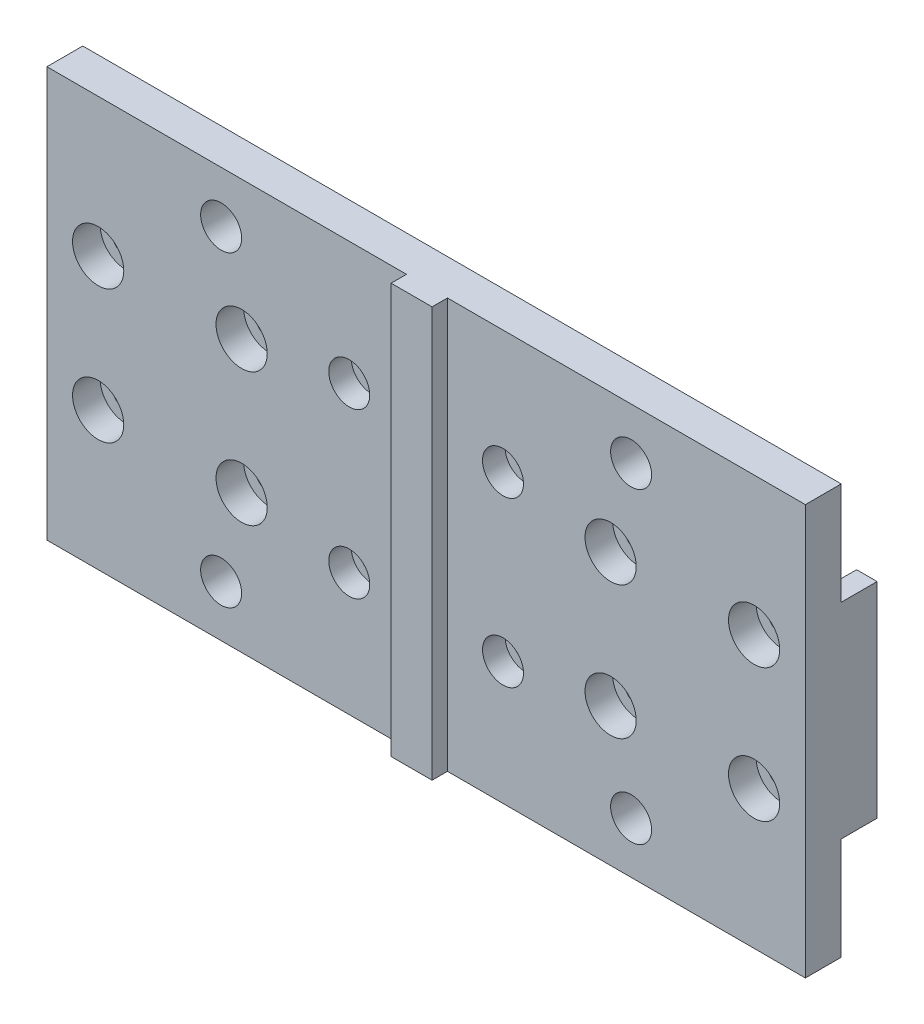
from build123d import *

# Parameters (mm, degrees)
ESQUISSE1_W                                        = 148
ESQUISSE1_H                                        = 80
ESQUISSE1_R                                        = 2.5
ESQUISSE1_R_2                                      = 2
EXTRUSION1_DEPTH                                   = 4
ESQUISSE2_R                                        = 4
ENL_V_MAT_EXTRU_1_DEPTH                            = 92.46462522
ESQUISSE3_W                                        = 148
ESQUISSE3_H                                        = 80
BOSS_EXTRU_1_DEPTH                                 = 3
CHAMBRAGE_POUR_VIS_T_TE_HEXAGONALE_M41_D           = 4.5
CHAMBRAGE_POUR_VIS_T_TE_HEXAGONALE_M41_CBORE_D     = 8
CHAMBRAGE_POUR_VIS_T_TE_HEXAGONALE_M41_CBORE_DEPTH = 4.4
CHAMBRAGE_POUR_VIS_T_TE_HEXAGONALE_M51_D           = 5.5
CHAMBRAGE_POUR_VIS_T_TE_HEXAGONALE_M51_CBORE_D     = 10
CHAMBRAGE_POUR_VIS_T_TE_HEXAGONALE_M51_CBORE_DEPTH = 5.4
ESQUISSE8_R                                        = 4
ENL_V_MAT_EXTRU_2_DEPTH                            = 92.644845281
BOSS_EXTRU_2_START                                 = 4
ESQUISSE9_W                                        = 148
ESQUISSE9_H                                        = 40
ESQUISSE9_R                                        = 2.75
ESQUISSE9_R_2                                      = 2.25
BOSS_EXTRU_2_DEPTH                                 = 4
ESQUISSE10_W                                       = 4
ESQUISSE10_H                                       = 40
ESQUISSE10_W_2                                     = 10
BOSS_EXTRU_3_DEPTH                                 = 3
ESQUISSE11_W                                       = 8
ESQUISSE11_H                                       = 80
BOSS_EXTRU_4_DEPTH                                 = 3


with BuildPart() as part:
    # Esquisse1 → Extrusion1 (new body)
    with BuildSketch(Plane.XY):
        with Locations((0, -13.607626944)):
            Rectangle(ESQUISSE1_W, ESQUISSE1_H)
        with Locations((-64, -0.607626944)):
            Circle(ESQUISSE1_R, mode=Mode.SUBTRACT)
        with Locations((-36, -0.607626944)):
            Circle(ESQUISSE1_R, mode=Mode.SUBTRACT)
        with Locations((-64, -26.607626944)):
            Circle(ESQUISSE1_R, mode=Mode.SUBTRACT)
        with Locations((-36, -26.607626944)):
            Circle(ESQUISSE1_R, mode=Mode.SUBTRACT)
        with Locations((36, -0.607626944)):
            Circle(ESQUISSE1_R, mode=Mode.SUBTRACT)
        with Locations((64, -0.607626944)):
            Circle(ESQUISSE1_R, mode=Mode.SUBTRACT)
        with Locations((36, -26.607626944)):
            Circle(ESQUISSE1_R, mode=Mode.SUBTRACT)
        with Locations((64, -26.607626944)):
            Circle(ESQUISSE1_R, mode=Mode.SUBTRACT)
        with Locations((15, 2.392373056)):
            Circle(ESQUISSE1_R_2, mode=Mode.SUBTRACT)
        with Locations((15, -29.607626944)):
            Circle(ESQUISSE1_R_2, mode=Mode.SUBTRACT)
        with Locations((-15, 2.392373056)):
            Circle(ESQUISSE1_R_2, mode=Mode.SUBTRACT)
        with Locations((-15, -29.607626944)):
            Circle(ESQUISSE1_R_2, mode=Mode.SUBTRACT)
    extrude(amount=EXTRUSION1_DEPTH)

    # Esquisse2 → Enl_v. mat.-Extru.1 (cut, through all)
    with BuildSketch(Plane.XY.offset(4)):
        with Locations((-40, 16.392373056)):
            Circle(ESQUISSE2_R)
        with Locations((-40, -43.607626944)):
            Circle(ESQUISSE2_R)
        with Locations((40, 16.392373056)):
            Circle(ESQUISSE2_R)
        with Locations((40, -43.607626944)):
            Circle(ESQUISSE2_R)
    extrude(amount=-ENL_V_MAT_EXTRU_1_DEPTH, mode=Mode.SUBTRACT)

    # Esquisse3 → Boss.-Extru.1 (add)
    with BuildSketch(Plane.XY.offset(4)):
        with Locations((0, -13.607626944)):
            Rectangle(ESQUISSE3_W, ESQUISSE3_H)
    extrude(amount=BOSS_EXTRU_1_DEPTH)

    # Chambrage pour vis _ t_te hexagonale M41 (through all)
    with Locations(Plane.XY.offset(7)):
        with Locations((-15, 2.392373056), (15, 2.392373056), (15, -29.607626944), (-15, -29.607626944)):
            CounterBoreHole(CHAMBRAGE_POUR_VIS_T_TE_HEXAGONALE_M41_D / 2, CHAMBRAGE_POUR_VIS_T_TE_HEXAGONALE_M41_CBORE_D / 2, CHAMBRAGE_POUR_VIS_T_TE_HEXAGONALE_M41_CBORE_DEPTH)

    # Chambrage pour vis _ t_te hexagonale M51 (through all)
    with Locations(Plane.XY.offset(7)):
        with Locations((-64, -0.607626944), (-36, -0.607626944), (-36, -26.607626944), (-64, -26.607626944), (36, -0.607626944), (64, -0.607626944), (64, -26.607626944), (36, -26.607626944)):
            CounterBoreHole(CHAMBRAGE_POUR_VIS_T_TE_HEXAGONALE_M51_D / 2, CHAMBRAGE_POUR_VIS_T_TE_HEXAGONALE_M51_CBORE_D / 2, CHAMBRAGE_POUR_VIS_T_TE_HEXAGONALE_M51_CBORE_DEPTH)

    # Esquisse8 → Enl_v. mat.-Extru.2 (cut, through all)
    with BuildSketch(Plane(origin=(0, 0, 0), x_dir=(-1, 0, 0), z_dir=(0, 0, -1))):
        with Locations(Location((40, -43.607626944, 0), (0, 0, 180))):
            Circle(ESQUISSE8_R)
        with Locations(Location((40, 16.392373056, 0), (0, 0, 180))):
            Circle(ESQUISSE8_R)
        with Locations(Location((-40, 16.392373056, 0), (0, 0, 180))):
            Circle(ESQUISSE8_R)
        with Locations(Location((-40, -43.607626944, 0), (0, 0, 180))):
            Circle(ESQUISSE8_R)
    extrude(amount=-ENL_V_MAT_EXTRU_2_DEPTH, mode=Mode.SUBTRACT)

    # Esquisse9 → Boss.-Extru.2 (add)
    with BuildSketch(Plane(origin=(0, 0, 0), x_dir=(-1, 0, 0), z_dir=(0, 0, -1)).offset(BOSS_EXTRU_2_START)):
        with Locations((0, -13.607626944)):
            Rectangle(ESQUISSE9_W, ESQUISSE9_H)
        with Locations(Location((-64, -0.607626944, 0), (0, 0, 180))):
            Circle(ESQUISSE9_R, mode=Mode.SUBTRACT)
        with Locations(Location((-64, -26.607626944, 0), (0, 0, 180))):
            Circle(ESQUISSE9_R, mode=Mode.SUBTRACT)
        with Locations(Location((-36, -0.607626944, 0), (0, 0, 180))):
            Circle(ESQUISSE9_R, mode=Mode.SUBTRACT)
        with Locations(Location((-36, -26.607626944, 0), (0, 0, 180))):
            Circle(ESQUISSE9_R, mode=Mode.SUBTRACT)
        with Locations(Location((-15, 2.392373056, 0), (0, 0, 180))):
            Circle(ESQUISSE9_R_2, mode=Mode.SUBTRACT)
        with Locations(Location((15, 2.392373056, 0), (0, 0, 180))):
            Circle(ESQUISSE9_R_2, mode=Mode.SUBTRACT)
        with Locations(Location((-15, -29.607626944, 0), (0, 0, 180))):
            Circle(ESQUISSE9_R_2, mode=Mode.SUBTRACT)
        with Locations(Location((15, -29.607626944, 0), (0, 0, 180))):
            Circle(ESQUISSE9_R_2, mode=Mode.SUBTRACT)
        with Locations(Location((36, -0.607626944, 0), (0, 0, 180))):
            Circle(ESQUISSE9_R, mode=Mode.SUBTRACT)
        with Locations(Location((64, -0.607626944, 0), (0, 0, 180))):
            Circle(ESQUISSE9_R, mode=Mode.SUBTRACT)
        with Locations(Location((36, -26.607626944, 0), (0, 0, 180))):
            Circle(ESQUISSE9_R, mode=Mode.SUBTRACT)
        with Locations(Location((64, -26.607626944, 0), (0, 0, 180))):
            Circle(ESQUISSE9_R, mode=Mode.SUBTRACT)
    extrude(amount=-BOSS_EXTRU_2_DEPTH)

    # Esquisse10 → Boss.-Extru.3 (add)
    with BuildSketch(Plane(origin=(0, 0, -4), x_dir=(-1, 0, 0), z_dir=(0, 0, -1))):
        with Locations((-72, -13.607626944)):
            Rectangle(ESQUISSE10_W, ESQUISSE10_H)
        with Locations((-25, -13.607626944)):
            Rectangle(ESQUISSE10_W_2, ESQUISSE10_H)
        with Locations((25, -13.607626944)):
            Rectangle(ESQUISSE10_W_2, ESQUISSE10_H)
        with Locations((72, -13.607626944)):
            Rectangle(ESQUISSE10_W, ESQUISSE10_H)
    extrude(amount=BOSS_EXTRU_3_DEPTH)

    # Esquisse11 → Boss.-Extru.4 (add)
    with BuildSketch(Plane.XY.offset(7)):
        with Locations((0.163625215, -13.607626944)):
            Rectangle(ESQUISSE11_W, ESQUISSE11_H)
    extrude(amount=BOSS_EXTRU_4_DEPTH)


solid = part.part
